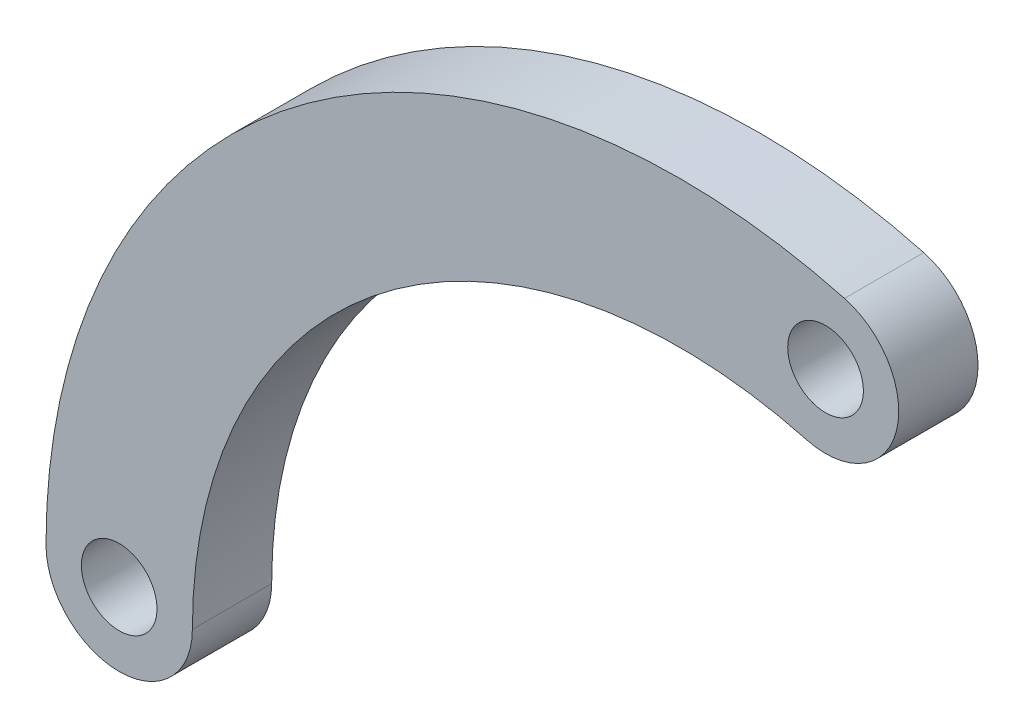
ISO-10303-21;
HEADER;
FILE_DESCRIPTION(('STEP AP214'),'2;1');
FILE_NAME('part.step','',(''),(''),'','','');
FILE_SCHEMA(('AUTOMOTIVE_DESIGN { 1 0 10303 214 1 1 1 1 }'));
ENDSEC;
DATA;
#1=APPLICATION_CONTEXT('core data for automotive mechanical design processes');
#2=APPLICATION_PROTOCOL_DEFINITION('international standard','automotive_design',2000,#1);
#3=PRODUCT_CONTEXT('',#1,'mechanical');
#4=PRODUCT('Part','Part','',(#3));
#5=PRODUCT_RELATED_PRODUCT_CATEGORY('part','',(#4));
#6=PRODUCT_DEFINITION_FORMATION('','',#4);
#7=PRODUCT_DEFINITION_CONTEXT('part definition',#1,'design');
#8=PRODUCT_DEFINITION('design','',#6,#7);
#9=PRODUCT_DEFINITION_SHAPE('','',#8);
#10=(LENGTH_UNIT() NAMED_UNIT(*) SI_UNIT(.MILLI.,.METRE.));
#11=(NAMED_UNIT(*) PLANE_ANGLE_UNIT() SI_UNIT($,.RADIAN.));
#12=(NAMED_UNIT(*) SI_UNIT($,.STERADIAN.) SOLID_ANGLE_UNIT());
#13=UNCERTAINTY_MEASURE_WITH_UNIT(LENGTH_MEASURE(1.E-05),#10,'distance_accuracy_value','');
#14=(GEOMETRIC_REPRESENTATION_CONTEXT(3) GLOBAL_UNCERTAINTY_ASSIGNED_CONTEXT((#13)) GLOBAL_UNIT_ASSIGNED_CONTEXT((#10,
#11,#12)) REPRESENTATION_CONTEXT('',''));
#15=CARTESIAN_POINT('',(0.,0.,0.));
#16=DIRECTION('',(0.,0.,1.));
#17=DIRECTION('',(1.,0.,0.));
#18=AXIS2_PLACEMENT_3D('',#15,#16,#17);
#19=CARTESIAN_POINT('',(-23.0000000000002,1.38777878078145E-13,6.5));
#20=DIRECTION('',(0.,0.,1.));
#21=DIRECTION('',(1.00000000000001,0.,0.));
#22=AXIS2_PLACEMENT_3D('',#19,#20,#21);
#23=PLANE('',#22);
#24=CARTESIAN_POINT('',(11.9056760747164,44.4325880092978,6.5));
#25=DIRECTION('',(0.,0.,1.));
#26=DIRECTION('',(1.00000000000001,0.,0.));
#27=AXIS2_PLACEMENT_3D('',#24,#25,#26);
#28=CIRCLE('',#27,3.1);
#29=CARTESIAN_POINT('',(8.80567607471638,44.4325880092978,6.5));
#30=VERTEX_POINT('',#29);
#31=EDGE_CURVE('E111',#30,#30,#28,.T.);
#32=ORIENTED_EDGE('',*,*,#31,.F.);
#33=EDGE_LOOP('',(#32));
#34=FACE_BOUND('',#33,.T.);
#35=CARTESIAN_POINT('',(-46.0000000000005,1.52655665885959E-13,6.5));
#36=DIRECTION('',(0.,0.,1.));
#37=DIRECTION('',(1.00000000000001,0.,0.));
#38=AXIS2_PLACEMENT_3D('',#35,#36,#37);
#39=CIRCLE('',#38,6.);
#40=CARTESIAN_POINT('',(-52.0000000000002,2.08166817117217E-13,6.5));
#41=VERTEX_POINT('',#40);
#42=CARTESIAN_POINT('',(-40.0000000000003,2.4980018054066E-13,6.5));
#43=VERTEX_POINT('',#42);
#44=EDGE_CURVE('E96',#41,#43,#39,.T.);
#45=ORIENTED_EDGE('',*,*,#44,.T.);
#46=CARTESIAN_POINT('',(0.,0.,6.5));
#47=DIRECTION('',(0.,0.,-1.));
#48=DIRECTION('',(1.00000000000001,0.,0.));
#49=AXIS2_PLACEMENT_3D('',#46,#47,#48);
#50=CIRCLE('',#49,40.);
#51=CARTESIAN_POINT('',(10.3527618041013,38.6370330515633,6.5));
#52=VERTEX_POINT('',#51);
#53=EDGE_CURVE('E91',#43,#52,#50,.T.);
#54=ORIENTED_EDGE('',*,*,#53,.T.);
#55=CARTESIAN_POINT('',(11.9056760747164,44.4325880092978,6.5));
#56=DIRECTION('',(0.,0.,1.));
#57=DIRECTION('',(-1.00000000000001,0.,0.));
#58=AXIS2_PLACEMENT_3D('',#55,#56,#57);
#59=CIRCLE('',#58,6.);
#60=CARTESIAN_POINT('',(13.4585903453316,50.2281429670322,6.5));
#61=VERTEX_POINT('',#60);
#62=EDGE_CURVE('E94',#52,#61,#59,.T.);
#63=ORIENTED_EDGE('',*,*,#62,.T.);
#64=CARTESIAN_POINT('',(0.,0.,6.5));
#65=DIRECTION('',(0.,0.,1.));
#66=DIRECTION('',(-1.00000000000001,0.,0.));
#67=AXIS2_PLACEMENT_3D('',#64,#65,#66);
#68=CIRCLE('',#67,52.);
#69=EDGE_CURVE('E61',#61,#41,#68,.T.);
#70=ORIENTED_EDGE('',*,*,#69,.T.);
#71=EDGE_LOOP('',(#45,#54,#63,#70));
#72=FACE_BOUND('',#71,.T.);
#73=CARTESIAN_POINT('',(-46.0000000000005,1.52655665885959E-13,6.5));
#74=DIRECTION('',(0.,0.,1.));
#75=DIRECTION('',(1.00000000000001,0.,0.));
#76=AXIS2_PLACEMENT_3D('',#73,#74,#75);
#77=CIRCLE('',#76,3.1);
#78=CARTESIAN_POINT('',(-49.1000000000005,1.52483581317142E-13,6.5));
#79=VERTEX_POINT('',#78);
#80=EDGE_CURVE('E126',#79,#79,#77,.T.);
#81=ORIENTED_EDGE('',*,*,#80,.F.);
#82=EDGE_LOOP('',(#81));
#83=FACE_BOUND('',#82,.T.);
#84=ADVANCED_FACE('F44',(#34,#72,#83),#23,.T.);
#85=CARTESIAN_POINT('',(-23.,0.,0.));
#86=DIRECTION('',(0.,0.,1.));
#87=DIRECTION('',(1.00000000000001,0.,0.));
#88=AXIS2_PLACEMENT_3D('',#85,#86,#87);
#89=PLANE('',#88);
#90=CARTESIAN_POINT('',(11.9056760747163,44.4325880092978,0.));
#91=DIRECTION('',(0.,0.,1.));
#92=DIRECTION('',(1.00000000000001,0.,0.));
#93=AXIS2_PLACEMENT_3D('',#90,#91,#92);
#94=CIRCLE('',#93,3.1);
#95=CARTESIAN_POINT('',(8.80567607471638,44.4325880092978,0.));
#96=VERTEX_POINT('',#95);
#97=EDGE_CURVE('E123',#96,#96,#94,.T.);
#98=ORIENTED_EDGE('',*,*,#97,.T.);
#99=EDGE_LOOP('',(#98));
#100=FACE_BOUND('',#99,.T.);
#101=CARTESIAN_POINT('',(-46.0000000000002,1.94289029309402E-13,0.));
#102=DIRECTION('',(0.,0.,1.));
#103=DIRECTION('',(1.00000000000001,0.,0.));
#104=AXIS2_PLACEMENT_3D('',#101,#102,#103);
#105=CIRCLE('',#104,6.);
#106=CARTESIAN_POINT('',(-52.0000000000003,1.80411241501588E-13,0.));
#107=VERTEX_POINT('',#106);
#108=CARTESIAN_POINT('',(-40.,0.,0.));
#109=VERTEX_POINT('',#108);
#110=EDGE_CURVE('E108',#107,#109,#105,.T.);
#111=ORIENTED_EDGE('',*,*,#110,.F.);
#112=CARTESIAN_POINT('',(0.,0.,0.));
#113=DIRECTION('',(0.,0.,1.));
#114=DIRECTION('',(-1.00000000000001,0.,0.));
#115=AXIS2_PLACEMENT_3D('',#112,#113,#114);
#116=CIRCLE('',#115,52.);
#117=CARTESIAN_POINT('',(13.4585903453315,50.2281429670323,0.));
#118=VERTEX_POINT('',#117);
#119=EDGE_CURVE('E84',#118,#107,#116,.T.);
#120=ORIENTED_EDGE('',*,*,#119,.F.);
#121=CARTESIAN_POINT('',(11.9056760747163,44.4325880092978,0.));
#122=DIRECTION('',(0.,0.,1.));
#123=DIRECTION('',(-1.00000000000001,0.,0.));
#124=AXIS2_PLACEMENT_3D('',#121,#122,#123);
#125=CIRCLE('',#124,6.);
#126=CARTESIAN_POINT('',(10.3527618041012,38.6370330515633,0.));
#127=VERTEX_POINT('',#126);
#128=EDGE_CURVE('E78',#127,#118,#125,.T.);
#129=ORIENTED_EDGE('',*,*,#128,.F.);
#130=CARTESIAN_POINT('',(0.,0.,0.));
#131=DIRECTION('',(0.,0.,-1.));
#132=DIRECTION('',(1.00000000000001,0.,0.));
#133=AXIS2_PLACEMENT_3D('',#130,#131,#132);
#134=CIRCLE('',#133,40.);
#135=EDGE_CURVE('E100',#109,#127,#134,.T.);
#136=ORIENTED_EDGE('',*,*,#135,.F.);
#137=EDGE_LOOP('',(#111,#120,#129,#136));
#138=FACE_BOUND('',#137,.T.);
#139=CARTESIAN_POINT('',(-46.0000000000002,1.94289029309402E-13,0.));
#140=DIRECTION('',(0.,0.,1.));
#141=DIRECTION('',(1.00000000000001,0.,0.));
#142=AXIS2_PLACEMENT_3D('',#139,#140,#141);
#143=CIRCLE('',#142,3.1);
#144=CARTESIAN_POINT('',(-49.1000000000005,1.52483581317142E-13,0.));
#145=VERTEX_POINT('',#144);
#146=EDGE_CURVE('E129',#145,#145,#143,.T.);
#147=ORIENTED_EDGE('',*,*,#146,.T.);
#148=EDGE_LOOP('',(#147));
#149=FACE_BOUND('',#148,.T.);
#150=ADVANCED_FACE('F119',(#100,#138,#149),#89,.F.);
#151=CARTESIAN_POINT('',(-46.0000000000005,1.52655665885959E-13,6.5));
#152=DIRECTION('',(0.,0.,-1.));
#153=DIRECTION('',(-1.00000000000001,0.,0.));
#154=AXIS2_PLACEMENT_3D('',#151,#152,#153);
#155=CYLINDRICAL_SURFACE('',#154,6.);
#156=ORIENTED_EDGE('',*,*,#110,.T.);
#157=DIRECTION('',(0.,0.,-1.));
#158=VECTOR('',#157,1.);
#159=CARTESIAN_POINT('',(-40.0000000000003,2.4980018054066E-13,6.5));
#160=LINE('',#159,#158);
#161=EDGE_CURVE('E13',#43,#109,#160,.T.);
#162=ORIENTED_EDGE('',*,*,#161,.F.);
#163=ORIENTED_EDGE('',*,*,#44,.F.);
#164=DIRECTION('',(0.,0.,-1.));
#165=VECTOR('',#164,1.);
#166=CARTESIAN_POINT('',(-52.0000000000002,2.08166817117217E-13,6.5));
#167=LINE('',#166,#165);
#168=EDGE_CURVE('E104',#41,#107,#167,.T.);
#169=ORIENTED_EDGE('',*,*,#168,.T.);
#170=EDGE_LOOP('',(#156,#162,#163,#169));
#171=FACE_BOUND('',#170,.T.);
#172=ADVANCED_FACE('F46',(#171),#155,.T.);
#173=CARTESIAN_POINT('',(0.,0.,6.5));
#174=DIRECTION('',(0.,0.,-1.));
#175=DIRECTION('',(-1.00000000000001,0.,0.));
#176=AXIS2_PLACEMENT_3D('',#173,#174,#175);
#177=CYLINDRICAL_SURFACE('',#176,40.);
#178=ORIENTED_EDGE('',*,*,#135,.T.);
#179=DIRECTION('',(0.,0.,-1.));
#180=VECTOR('',#179,1.);
#181=CARTESIAN_POINT('',(10.3527618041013,38.6370330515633,6.5));
#182=LINE('',#181,#180);
#183=EDGE_CURVE('E53',#52,#127,#182,.T.);
#184=ORIENTED_EDGE('',*,*,#183,.F.);
#185=ORIENTED_EDGE('',*,*,#53,.F.);
#186=ORIENTED_EDGE('',*,*,#161,.T.);
#187=EDGE_LOOP('',(#178,#184,#185,#186));
#188=FACE_BOUND('',#187,.T.);
#189=ADVANCED_FACE('F99',(#188),#177,.F.);
#190=CARTESIAN_POINT('',(11.9056760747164,44.4325880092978,6.5));
#191=DIRECTION('',(0.,0.,-1.));
#192=DIRECTION('',(-1.00000000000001,0.,0.));
#193=AXIS2_PLACEMENT_3D('',#190,#191,#192);
#194=CYLINDRICAL_SURFACE('',#193,6.);
#195=ORIENTED_EDGE('',*,*,#128,.T.);
#196=DIRECTION('',(0.,0.,-1.));
#197=VECTOR('',#196,1.);
#198=CARTESIAN_POINT('',(13.4585903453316,50.2281429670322,6.5));
#199=LINE('',#198,#197);
#200=EDGE_CURVE('E101',#61,#118,#199,.T.);
#201=ORIENTED_EDGE('',*,*,#200,.F.);
#202=ORIENTED_EDGE('',*,*,#62,.F.);
#203=ORIENTED_EDGE('',*,*,#183,.T.);
#204=EDGE_LOOP('',(#195,#201,#202,#203));
#205=FACE_BOUND('',#204,.T.);
#206=ADVANCED_FACE('F102',(#205),#194,.T.);
#207=CARTESIAN_POINT('',(0.,0.,6.5));
#208=DIRECTION('',(0.,0.,-1.));
#209=DIRECTION('',(-1.00000000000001,0.,0.));
#210=AXIS2_PLACEMENT_3D('',#207,#208,#209);
#211=CYLINDRICAL_SURFACE('',#210,52.);
#212=ORIENTED_EDGE('',*,*,#119,.T.);
#213=ORIENTED_EDGE('',*,*,#168,.F.);
#214=ORIENTED_EDGE('',*,*,#69,.F.);
#215=ORIENTED_EDGE('',*,*,#200,.T.);
#216=EDGE_LOOP('',(#212,#213,#214,#215));
#217=FACE_BOUND('',#216,.T.);
#218=ADVANCED_FACE('F116',(#217),#211,.T.);
#219=CARTESIAN_POINT('',(11.9056760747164,44.4325880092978,6.5));
#220=DIRECTION('',(0.,0.,-1.));
#221=DIRECTION('',(-1.00000000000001,0.,0.));
#222=AXIS2_PLACEMENT_3D('',#219,#220,#221);
#223=CYLINDRICAL_SURFACE('',#222,3.1);
#224=CARTESIAN_POINT('',(8.80567607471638,44.4325880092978,6.5));
#225=CARTESIAN_POINT('',(8.80567607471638,44.4325880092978,6.43229166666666));
#226=CARTESIAN_POINT('',(8.80567607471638,44.4325880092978,6.36458333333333));
#227=CARTESIAN_POINT('',(8.80567607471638,44.4325880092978,6.22916666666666));
#228=CARTESIAN_POINT('',(8.80567607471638,44.4325880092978,6.16145833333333));
#229=CARTESIAN_POINT('',(8.80567607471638,44.4325880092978,6.02604166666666));
#230=CARTESIAN_POINT('',(8.80567607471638,44.4325880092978,5.95833333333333));
#231=CARTESIAN_POINT('',(8.80567607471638,44.4325880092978,5.82291666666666));
#232=CARTESIAN_POINT('',(8.80567607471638,44.4325880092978,5.75520833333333));
#233=CARTESIAN_POINT('',(8.80567607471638,44.4325880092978,5.61979166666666));
#234=CARTESIAN_POINT('',(8.80567607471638,44.4325880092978,5.55208333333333));
#235=CARTESIAN_POINT('',(8.80567607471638,44.4325880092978,5.41666666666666));
#236=CARTESIAN_POINT('',(8.80567607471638,44.4325880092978,5.34895833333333));
#237=CARTESIAN_POINT('',(8.80567607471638,44.4325880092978,5.21354166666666));
#238=CARTESIAN_POINT('',(8.80567607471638,44.4325880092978,5.14583333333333));
#239=CARTESIAN_POINT('',(8.80567607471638,44.4325880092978,5.01041666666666));
#240=CARTESIAN_POINT('',(8.80567607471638,44.4325880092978,4.94270833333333));
#241=CARTESIAN_POINT('',(8.80567607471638,44.4325880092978,4.80729166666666));
#242=CARTESIAN_POINT('',(8.80567607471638,44.4325880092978,4.73958333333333));
#243=CARTESIAN_POINT('',(8.80567607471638,44.4325880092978,4.60416666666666));
#244=CARTESIAN_POINT('',(8.80567607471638,44.4325880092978,4.53645833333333));
#245=CARTESIAN_POINT('',(8.80567607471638,44.4325880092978,4.40104166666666));
#246=CARTESIAN_POINT('',(8.80567607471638,44.4325880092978,4.33333333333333));
#247=CARTESIAN_POINT('',(8.80567607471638,44.4325880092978,4.19791666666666));
#248=CARTESIAN_POINT('',(8.80567607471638,44.4325880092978,4.13020833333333));
#249=CARTESIAN_POINT('',(8.80567607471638,44.4325880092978,3.99479166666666));
#250=CARTESIAN_POINT('',(8.80567607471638,44.4325880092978,3.92708333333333));
#251=CARTESIAN_POINT('',(8.80567607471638,44.4325880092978,3.79166666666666));
#252=CARTESIAN_POINT('',(8.80567607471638,44.4325880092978,3.72395833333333));
#253=CARTESIAN_POINT('',(8.80567607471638,44.4325880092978,3.58854166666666));
#254=CARTESIAN_POINT('',(8.80567607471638,44.4325880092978,3.52083333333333));
#255=CARTESIAN_POINT('',(8.80567607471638,44.4325880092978,3.38541666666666));
#256=CARTESIAN_POINT('',(8.80567607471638,44.4325880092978,3.31770833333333));
#257=CARTESIAN_POINT('',(8.80567607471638,44.4325880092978,3.18229166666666));
#258=CARTESIAN_POINT('',(8.80567607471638,44.4325880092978,3.11458333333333));
#259=CARTESIAN_POINT('',(8.80567607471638,44.4325880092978,2.97916666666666));
#260=CARTESIAN_POINT('',(8.80567607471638,44.4325880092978,2.91145833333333));
#261=CARTESIAN_POINT('',(8.80567607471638,44.4325880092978,2.77604166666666));
#262=CARTESIAN_POINT('',(8.80567607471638,44.4325880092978,2.70833333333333));
#263=CARTESIAN_POINT('',(8.80567607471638,44.4325880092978,2.57291666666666));
#264=CARTESIAN_POINT('',(8.80567607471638,44.4325880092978,2.50520833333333));
#265=CARTESIAN_POINT('',(8.80567607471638,44.4325880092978,2.36979166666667));
#266=CARTESIAN_POINT('',(8.80567607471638,44.4325880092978,2.30208333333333));
#267=CARTESIAN_POINT('',(8.80567607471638,44.4325880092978,2.16666666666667));
#268=CARTESIAN_POINT('',(8.80567607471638,44.4325880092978,2.09895833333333));
#269=CARTESIAN_POINT('',(8.80567607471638,44.4325880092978,1.96354166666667));
#270=CARTESIAN_POINT('',(8.80567607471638,44.4325880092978,1.89583333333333));
#271=CARTESIAN_POINT('',(8.80567607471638,44.4325880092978,1.76041666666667));
#272=CARTESIAN_POINT('',(8.80567607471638,44.4325880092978,1.69270833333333));
#273=CARTESIAN_POINT('',(8.80567607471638,44.4325880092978,1.55729166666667));
#274=CARTESIAN_POINT('',(8.80567607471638,44.4325880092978,1.48958333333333));
#275=CARTESIAN_POINT('',(8.80567607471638,44.4325880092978,1.35416666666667));
#276=CARTESIAN_POINT('',(8.80567607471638,44.4325880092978,1.28645833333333));
#277=CARTESIAN_POINT('',(8.80567607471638,44.4325880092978,1.15104166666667));
#278=CARTESIAN_POINT('',(8.80567607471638,44.4325880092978,1.08333333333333));
#279=CARTESIAN_POINT('',(8.80567607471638,44.4325880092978,0.947916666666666));
#280=CARTESIAN_POINT('',(8.80567607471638,44.4325880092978,0.880208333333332));
#281=CARTESIAN_POINT('',(8.80567607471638,44.4325880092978,0.744791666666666));
#282=CARTESIAN_POINT('',(8.80567607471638,44.4325880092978,0.677083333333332));
#283=CARTESIAN_POINT('',(8.80567607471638,44.4325880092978,0.541666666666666));
#284=CARTESIAN_POINT('',(8.80567607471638,44.4325880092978,0.473958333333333));
#285=CARTESIAN_POINT('',(8.80567607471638,44.4325880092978,0.338541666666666));
#286=CARTESIAN_POINT('',(8.80567607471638,44.4325880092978,0.270833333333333));
#287=CARTESIAN_POINT('',(8.80567607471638,44.4325880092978,0.135416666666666));
#288=CARTESIAN_POINT('',(8.80567607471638,44.4325880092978,0.0677083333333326));
#289=CARTESIAN_POINT('',(8.80567607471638,44.4325880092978,0.));
#290=B_SPLINE_CURVE_WITH_KNOTS('',3,(#224,#225,#226,#227,#228,#229,#230,#231,#232,#233,#234,
#235,#236,#237,#238,#239,#240,#241,#242,#243,#244,#245,#246,#247,#248,#249,#250,#251,#252,#253,
#254,#255,#256,#257,#258,#259,#260,#261,#262,#263,#264,#265,#266,#267,#268,#269,#270,#271,#272,
#273,#274,#275,#276,#277,#278,#279,#280,#281,#282,#283,#284,#285,#286,#287,#288,#289),
.UNSPECIFIED.,.F.,.F.,(4,2,2,2,2,2,2,2,2,2,2,2,2,2,2,2,2,2,2,2,2,2,2,2,2,2,2,2,2,2,2,2,4),(0.,
0.203125,0.40625,0.609375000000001,0.8125,1.015625,1.21875,1.421875,1.625,1.828125,2.03125,
2.234375,2.4375,2.640625,2.84375,3.046875,3.25,3.453125,3.65625,3.859375,4.0625,4.265625,
4.46875,4.671875,4.875,5.078125,5.28125,5.484375,5.6875,5.890625,6.09375,6.296875,6.5),.UNSPECIFIED.);
#291=EDGE_CURVE('BSEAM147',#30,#96,#290,.T.);
#292=ORIENTED_EDGE('',*,*,#31,.T.);
#293=ORIENTED_EDGE('',*,*,#97,.F.);
#294=ORIENTED_EDGE('',*,*,#291,.T.);
#295=ORIENTED_EDGE('',*,*,#291,.F.);
#296=EDGE_LOOP('',(#292,#294,#293,#295));
#297=FACE_BOUND('',#296,.T.);
#298=ADVANCED_FACE('F147',(#297),#223,.F.);
#299=CARTESIAN_POINT('',(-46.0000000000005,1.52655665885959E-13,6.5));
#300=DIRECTION('',(0.,0.,-1.));
#301=DIRECTION('',(-1.00000000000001,0.,0.));
#302=AXIS2_PLACEMENT_3D('',#299,#300,#301);
#303=CYLINDRICAL_SURFACE('',#302,3.1);
#304=CARTESIAN_POINT('',(-49.1000000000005,1.52483581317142E-13,6.5));
#305=CARTESIAN_POINT('',(-49.1000000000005,1.52483581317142E-13,6.43229166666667));
#306=CARTESIAN_POINT('',(-49.1000000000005,1.52483581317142E-13,6.36458333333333));
#307=CARTESIAN_POINT('',(-49.1000000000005,1.52483581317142E-13,6.22916666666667));
#308=CARTESIAN_POINT('',(-49.1000000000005,1.52483581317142E-13,6.16145833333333));
#309=CARTESIAN_POINT('',(-49.1000000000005,1.52483581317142E-13,6.02604166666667));
#310=CARTESIAN_POINT('',(-49.1000000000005,1.52483581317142E-13,5.95833333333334));
#311=CARTESIAN_POINT('',(-49.1000000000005,1.52483581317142E-13,5.82291666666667));
#312=CARTESIAN_POINT('',(-49.1000000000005,1.52483581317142E-13,5.75520833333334));
#313=CARTESIAN_POINT('',(-49.1000000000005,1.52483581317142E-13,5.61979166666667));
#314=CARTESIAN_POINT('',(-49.1000000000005,1.52483581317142E-13,5.55208333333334));
#315=CARTESIAN_POINT('',(-49.1000000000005,1.52483581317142E-13,5.41666666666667));
#316=CARTESIAN_POINT('',(-49.1000000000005,1.52483581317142E-13,5.34895833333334));
#317=CARTESIAN_POINT('',(-49.1000000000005,1.52483581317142E-13,5.21354166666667));
#318=CARTESIAN_POINT('',(-49.1000000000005,1.52483581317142E-13,5.14583333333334));
#319=CARTESIAN_POINT('',(-49.1000000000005,1.52483581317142E-13,5.01041666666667));
#320=CARTESIAN_POINT('',(-49.1000000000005,1.52483581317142E-13,4.94270833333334));
#321=CARTESIAN_POINT('',(-49.1000000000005,1.52483581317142E-13,4.80729166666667));
#322=CARTESIAN_POINT('',(-49.1000000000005,1.52483581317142E-13,4.73958333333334));
#323=CARTESIAN_POINT('',(-49.1000000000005,1.52483581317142E-13,4.60416666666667));
#324=CARTESIAN_POINT('',(-49.1000000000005,1.52483581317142E-13,4.53645833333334));
#325=CARTESIAN_POINT('',(-49.1000000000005,1.52483581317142E-13,4.40104166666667));
#326=CARTESIAN_POINT('',(-49.1000000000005,1.52483581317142E-13,4.33333333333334));
#327=CARTESIAN_POINT('',(-49.1000000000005,1.52483581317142E-13,4.19791666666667));
#328=CARTESIAN_POINT('',(-49.1000000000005,1.52483581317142E-13,4.13020833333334));
#329=CARTESIAN_POINT('',(-49.1000000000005,1.52483581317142E-13,3.99479166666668));
#330=CARTESIAN_POINT('',(-49.1000000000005,1.52483581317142E-13,3.92708333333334));
#331=CARTESIAN_POINT('',(-49.1000000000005,1.52483581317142E-13,3.79166666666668));
#332=CARTESIAN_POINT('',(-49.1000000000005,1.52483581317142E-13,3.72395833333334));
#333=CARTESIAN_POINT('',(-49.1000000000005,1.52483581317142E-13,3.58854166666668));
#334=CARTESIAN_POINT('',(-49.1000000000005,1.52483581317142E-13,3.52083333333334));
#335=CARTESIAN_POINT('',(-49.1000000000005,1.52483581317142E-13,3.38541666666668));
#336=CARTESIAN_POINT('',(-49.1000000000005,1.52483581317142E-13,3.31770833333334));
#337=CARTESIAN_POINT('',(-49.1000000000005,1.52483581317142E-13,3.18229166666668));
#338=CARTESIAN_POINT('',(-49.1000000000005,1.52483581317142E-13,3.11458333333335));
#339=CARTESIAN_POINT('',(-49.1000000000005,1.52483581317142E-13,2.97916666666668));
#340=CARTESIAN_POINT('',(-49.1000000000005,1.52483581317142E-13,2.91145833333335));
#341=CARTESIAN_POINT('',(-49.1000000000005,1.52483581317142E-13,2.77604166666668));
#342=CARTESIAN_POINT('',(-49.1000000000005,1.52483581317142E-13,2.70833333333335));
#343=CARTESIAN_POINT('',(-49.1000000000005,1.52483581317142E-13,2.57291666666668));
#344=CARTESIAN_POINT('',(-49.1000000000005,1.52483581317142E-13,2.50520833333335));
#345=CARTESIAN_POINT('',(-49.1000000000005,1.52483581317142E-13,2.36979166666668));
#346=CARTESIAN_POINT('',(-49.1000000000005,1.52483581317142E-13,2.30208333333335));
#347=CARTESIAN_POINT('',(-49.1000000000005,1.52483581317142E-13,2.16666666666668));
#348=CARTESIAN_POINT('',(-49.1000000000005,1.52483581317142E-13,2.09895833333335));
#349=CARTESIAN_POINT('',(-49.1000000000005,1.52483581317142E-13,1.96354166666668));
#350=CARTESIAN_POINT('',(-49.1000000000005,1.52483581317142E-13,1.89583333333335));
#351=CARTESIAN_POINT('',(-49.1000000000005,1.52483581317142E-13,1.76041666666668));
#352=CARTESIAN_POINT('',(-49.1000000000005,1.52483581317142E-13,1.69270833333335));
#353=CARTESIAN_POINT('',(-49.1000000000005,1.52483581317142E-13,1.55729166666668));
#354=CARTESIAN_POINT('',(-49.1000000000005,1.52483581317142E-13,1.48958333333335));
#355=CARTESIAN_POINT('',(-49.1000000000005,1.52483581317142E-13,1.35416666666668));
#356=CARTESIAN_POINT('',(-49.1000000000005,1.52483581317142E-13,1.28645833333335));
#357=CARTESIAN_POINT('',(-49.1000000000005,1.52483581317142E-13,1.15104166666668));
#358=CARTESIAN_POINT('',(-49.1000000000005,1.52483581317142E-13,1.08333333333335));
#359=CARTESIAN_POINT('',(-49.1000000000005,1.52483581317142E-13,0.947916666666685));
#360=CARTESIAN_POINT('',(-49.1000000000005,1.52483581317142E-13,0.880208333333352));
#361=CARTESIAN_POINT('',(-49.1000000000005,1.52483581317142E-13,0.744791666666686));
#362=CARTESIAN_POINT('',(-49.1000000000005,1.52483581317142E-13,0.677083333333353));
#363=CARTESIAN_POINT('',(-49.1000000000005,1.52483581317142E-13,0.541666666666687));
#364=CARTESIAN_POINT('',(-49.1000000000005,1.52483581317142E-13,0.473958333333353));
#365=CARTESIAN_POINT('',(-49.1000000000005,1.52483581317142E-13,0.338541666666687));
#366=CARTESIAN_POINT('',(-49.1000000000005,1.52483581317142E-13,0.270833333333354));
#367=CARTESIAN_POINT('',(-49.1000000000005,1.52483581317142E-13,0.135416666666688));
#368=CARTESIAN_POINT('',(-49.1000000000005,1.52483581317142E-13,0.0677083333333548));
#369=CARTESIAN_POINT('',(-49.1000000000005,1.52483581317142E-13,0.));
#370=B_SPLINE_CURVE_WITH_KNOTS('',3,(#304,#305,#306,#307,#308,#309,#310,#311,#312,#313,#314,
#315,#316,#317,#318,#319,#320,#321,#322,#323,#324,#325,#326,#327,#328,#329,#330,#331,#332,#333,
#334,#335,#336,#337,#338,#339,#340,#341,#342,#343,#344,#345,#346,#347,#348,#349,#350,#351,#352,
#353,#354,#355,#356,#357,#358,#359,#360,#361,#362,#363,#364,#365,#366,#367,#368,#369),
.UNSPECIFIED.,.F.,.F.,(4,2,2,2,2,2,2,2,2,2,2,2,2,2,2,2,2,2,2,2,2,2,2,2,2,2,2,2,2,2,2,2,4),(0.,
0.203124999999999,0.406249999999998,0.609374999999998,0.812499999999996,1.015625,1.21875,
1.421875,1.62499999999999,1.82812499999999,2.03124999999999,2.23437499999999,2.43749999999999,
2.64062499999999,2.84374999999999,3.04687499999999,3.24999999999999,3.45312499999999,
3.65624999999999,3.85937499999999,4.06249999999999,4.26562499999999,4.46874999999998,
4.67187499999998,4.87499999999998,5.07812499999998,5.28124999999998,5.48437499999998,
5.68749999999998,5.89062499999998,6.09374999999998,6.29687499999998,6.49999999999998),.UNSPECIFIED.);
#371=EDGE_CURVE('BSEAM135',#79,#145,#370,.T.);
#372=ORIENTED_EDGE('',*,*,#80,.T.);
#373=ORIENTED_EDGE('',*,*,#146,.F.);
#374=ORIENTED_EDGE('',*,*,#371,.T.);
#375=ORIENTED_EDGE('',*,*,#371,.F.);
#376=EDGE_LOOP('',(#372,#374,#373,#375));
#377=FACE_BOUND('',#376,.T.);
#378=ADVANCED_FACE('F135',(#377),#303,.F.);
#379=CLOSED_SHELL('',(#84,#150,#172,#189,#206,#218,#298,#378));
#380=MANIFOLD_SOLID_BREP('B2',#379);
#381=ADVANCED_BREP_SHAPE_REPRESENTATION('',(#18,#380),#14);
#382=SHAPE_DEFINITION_REPRESENTATION(#9,#381);
ENDSEC;
END-ISO-10303-21;
